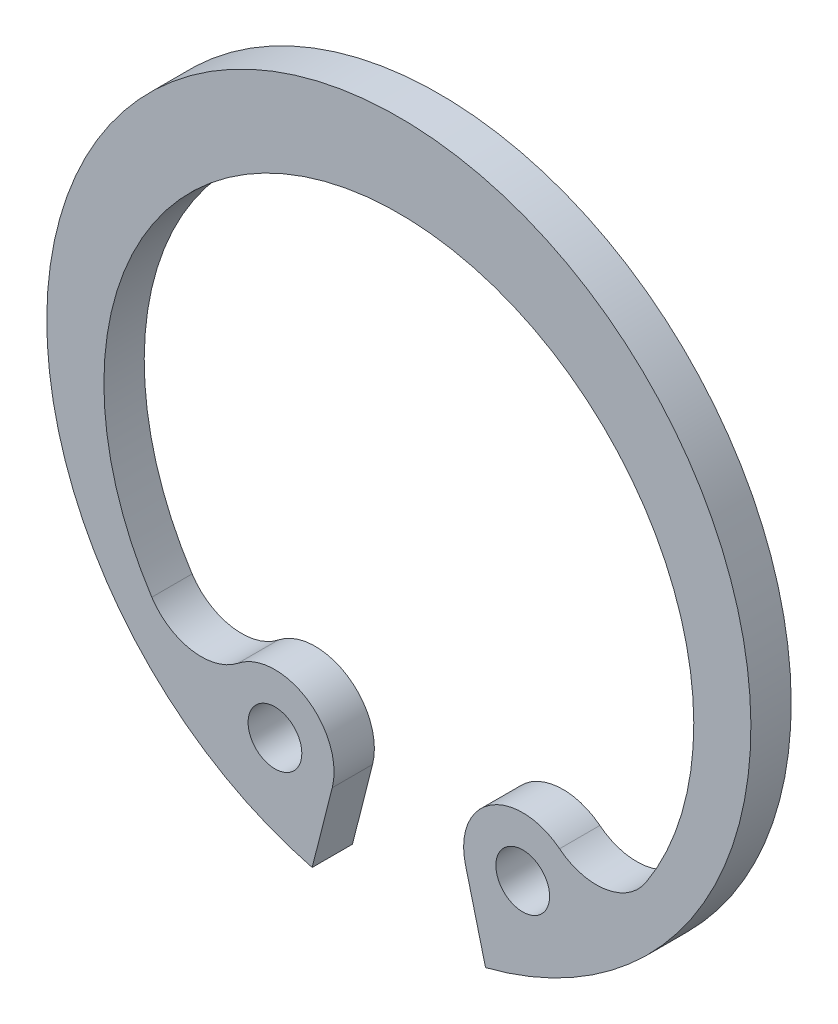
from build123d import *

# Parameters (mm, degrees)
BODYSKE_R  = 1
BODY_DEPTH = 1.5


with BuildPart() as part:
    # BodySke → Body (new body)
    with BuildSketch(Plane.XY):
        with BuildLine():
            Line((3.225876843, -12.69660264), (2.477844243, -9.752450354))
            ThreePointArc((2.477844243, -9.752450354), (3.416111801, -7.362891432), (5.980158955, -7.489382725))
            ThreePointArc((5.980158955, -7.489382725), (7.701462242, -7.939845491), (9.193020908, -6.96976588))
            ThreePointArc((9.193020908, -6.96976588), (0, 10), (-9.193020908, -6.96976588))
            ThreePointArc((-9.193020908, -6.96976588), (-7.701462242, -7.939845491), (-5.980158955, -7.489382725))
            ThreePointArc((-5.980158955, -7.489382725), (-3.416111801, -7.362891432), (-2.477844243, -9.752450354))
            Line((-2.477844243, -9.752450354), (-3.225876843, -12.69660264))
            ThreePointArc((-3.225876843, -12.69660264), (0, 13.1), (3.225876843, -12.69660264))
        make_face()
        with Locations((4.610098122, -9.210700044)):
            Circle(BODYSKE_R, mode=Mode.SUBTRACT)
        with Locations((-4.610098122, -9.210700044)):
            Circle(BODYSKE_R, mode=Mode.SUBTRACT)
    extrude(amount=-BODY_DEPTH)


solid = part.part
